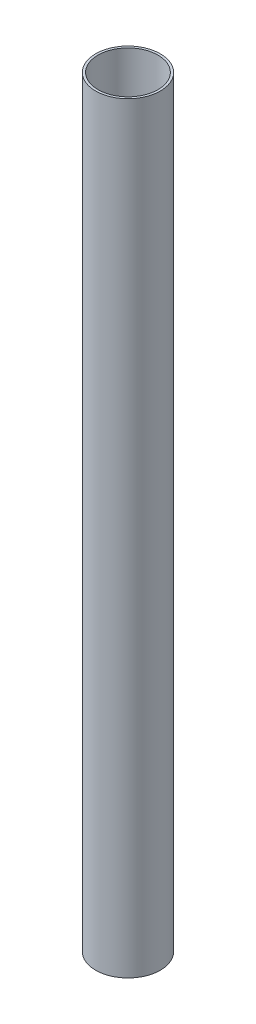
from build123d import *

# Parameters (mm, degrees)
SKETCH2_R           = 14
SKETCH2_R_2         = 13
BOSS_EXTRUDE1_DEPTH = 330


with BuildPart() as part:
    # Sketch2 → Boss-Extrude1 (new body)
    with BuildSketch(Plane(origin=(0, 0, 0), x_dir=(1, 0, 0), z_dir=(0, 1, 0))):
        with Locations(Location((0, 0, 0), (0, 0, 270))):
            Circle(SKETCH2_R)
        with Locations(Location((0, 0, 0), (0, 0, 270))):
            Circle(SKETCH2_R_2, mode=Mode.SUBTRACT)
    extrude(amount=-BOSS_EXTRUDE1_DEPTH)


solid = part.part
